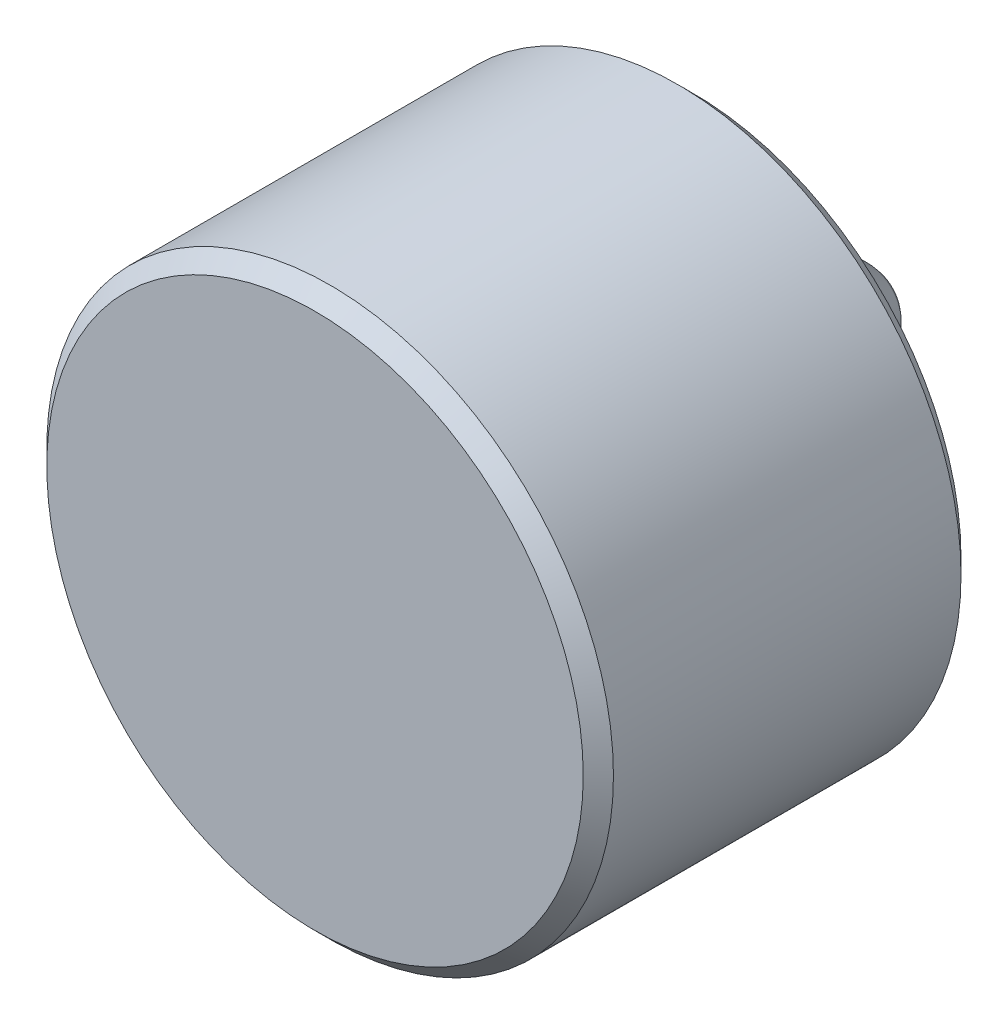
from build123d import *


with BuildPart() as part:
    # Sketch 1 → Revolve 1 (revolve)
    with BuildSketch(Plane(origin=(0, 0, 0), x_dir=(0, 0, -1), z_dir=(1, 0, 0)), mode=Mode.PRIVATE) as revolve_1_sk:
        with BuildLine():
            Line((0, 0), (0, 4.5085))
            Line((0, 4.5085), (0.254, 4.7625))
            Line((0.254, 4.7625), (6.096, 4.7625))
            Line((6.096, 4.7625), (6.35, 4.5085))
            Line((6.35, 4.5085), (6.35, 3.503782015))
            Line((6.35, 3.503782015), (9.292516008, 0.561266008))
            ThreePointArc((9.292516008, 0.561266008), (9.464579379, 0.303754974), (9.525, 0))
            Line((9.525, 0), (0, 0))
        make_face()
    revolve(revolve_1_sk.sketch.rotate(Axis((0, 0, 0), (0, 0, -1)), 90), axis=Axis((0, 0, 0), (0, 0, -1)))


solid = part.part
